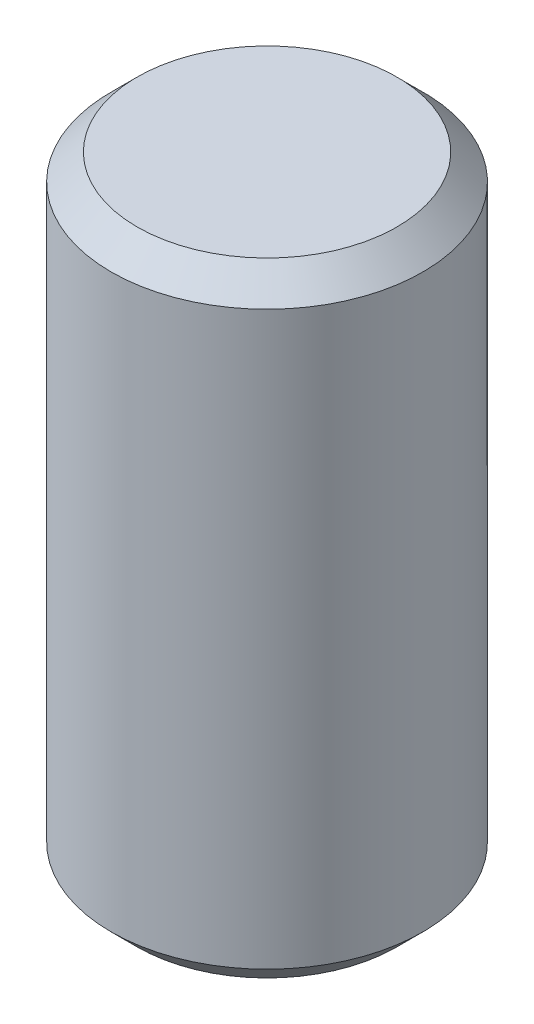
ISO-10303-21;
HEADER;
FILE_DESCRIPTION(('STEP AP214'),'2;1');
FILE_NAME('part.step','',(''),(''),'','','');
FILE_SCHEMA(('AUTOMOTIVE_DESIGN { 1 0 10303 214 1 1 1 1 }'));
ENDSEC;
DATA;
#1=APPLICATION_CONTEXT('core data for automotive mechanical design processes');
#2=APPLICATION_PROTOCOL_DEFINITION('international standard','automotive_design',2000,#1);
#3=PRODUCT_CONTEXT('',#1,'mechanical');
#4=PRODUCT('Part','Part','',(#3));
#5=PRODUCT_RELATED_PRODUCT_CATEGORY('part','',(#4));
#6=PRODUCT_DEFINITION_FORMATION('','',#4);
#7=PRODUCT_DEFINITION_CONTEXT('part definition',#1,'design');
#8=PRODUCT_DEFINITION('design','',#6,#7);
#9=PRODUCT_DEFINITION_SHAPE('','',#8);
#10=(LENGTH_UNIT() NAMED_UNIT(*) SI_UNIT(.MILLI.,.METRE.));
#11=(NAMED_UNIT(*) PLANE_ANGLE_UNIT() SI_UNIT($,.RADIAN.));
#12=(NAMED_UNIT(*) SI_UNIT($,.STERADIAN.) SOLID_ANGLE_UNIT());
#13=UNCERTAINTY_MEASURE_WITH_UNIT(LENGTH_MEASURE(1.E-05),#10,'distance_accuracy_value','');
#14=(GEOMETRIC_REPRESENTATION_CONTEXT(3) GLOBAL_UNCERTAINTY_ASSIGNED_CONTEXT((#13)) GLOBAL_UNIT_ASSIGNED_CONTEXT((#10,
#11,#12)) REPRESENTATION_CONTEXT('',''));
#15=CARTESIAN_POINT('',(0.,0.,0.));
#16=DIRECTION('',(0.,0.,1.));
#17=DIRECTION('',(1.,0.,0.));
#18=AXIS2_PLACEMENT_3D('',#15,#16,#17);
#19=CARTESIAN_POINT('',(0.,6.,0.));
#20=DIRECTION('',(0.,-1.,0.));
#21=DIRECTION('',(0.,0.,-1.));
#22=AXIS2_PLACEMENT_3D('',#19,#20,#21);
#23=CYLINDRICAL_SURFACE('',#22,1.5);
#24=CARTESIAN_POINT('',(0.,0.25,0.));
#25=DIRECTION('',(0.,1.,0.));
#26=DIRECTION('',(0.,0.,1.));
#27=AXIS2_PLACEMENT_3D('',#24,#25,#26);
#28=CIRCLE('',#27,1.5);
#29=CARTESIAN_POINT('',(0.,0.25,1.5));
#30=VERTEX_POINT('',#29);
#31=EDGE_CURVE('E44',#30,#30,#28,.T.);
#32=ORIENTED_EDGE('',*,*,#31,.T.);
#33=EDGE_LOOP('',(#32));
#34=FACE_BOUND('',#33,.T.);
#35=CARTESIAN_POINT('',(0.,5.75,0.));
#36=DIRECTION('',(0.,1.,0.));
#37=DIRECTION('',(0.,0.,1.));
#38=AXIS2_PLACEMENT_3D('',#35,#36,#37);
#39=CIRCLE('',#38,1.5);
#40=CARTESIAN_POINT('',(0.,5.75,1.5));
#41=VERTEX_POINT('',#40);
#42=EDGE_CURVE('E48',#41,#41,#39,.F.);
#43=ORIENTED_EDGE('',*,*,#42,.T.);
#44=EDGE_LOOP('',(#43));
#45=FACE_BOUND('',#44,.T.);
#46=ADVANCED_FACE('F32',(#34,#45),#23,.T.);
#47=CARTESIAN_POINT('',(0.,6.,0.));
#48=DIRECTION('',(0.,1.,0.));
#49=DIRECTION('',(0.,0.,1.));
#50=AXIS2_PLACEMENT_3D('',#47,#48,#49);
#51=PLANE('',#50);
#52=CARTESIAN_POINT('',(0.,6.,0.));
#53=DIRECTION('',(0.,1.,0.));
#54=DIRECTION('',(0.,0.,1.));
#55=AXIS2_PLACEMENT_3D('',#52,#53,#54);
#56=CIRCLE('',#55,1.25);
#57=CARTESIAN_POINT('',(0.,6.,1.25));
#58=VERTEX_POINT('',#57);
#59=EDGE_CURVE('E10',#58,#58,#56,.T.);
#60=ORIENTED_EDGE('',*,*,#59,.T.);
#61=EDGE_LOOP('',(#60));
#62=FACE_BOUND('',#61,.T.);
#63=ADVANCED_FACE('F64',(#62),#51,.T.);
#64=CARTESIAN_POINT('',(0.,0.,0.));
#65=DIRECTION('',(0.,1.,0.));
#66=DIRECTION('',(0.,0.,1.));
#67=AXIS2_PLACEMENT_3D('',#64,#65,#66);
#68=PLANE('',#67);
#69=CARTESIAN_POINT('',(0.,0.,0.));
#70=DIRECTION('',(0.,1.,0.));
#71=DIRECTION('',(0.,0.,1.));
#72=AXIS2_PLACEMENT_3D('',#69,#70,#71);
#73=CIRCLE('',#72,1.25);
#74=CARTESIAN_POINT('',(0.,0.,1.25));
#75=VERTEX_POINT('',#74);
#76=EDGE_CURVE('E40',#75,#75,#73,.F.);
#77=ORIENTED_EDGE('',*,*,#76,.T.);
#78=EDGE_LOOP('',(#77));
#79=FACE_BOUND('',#78,.T.);
#80=ADVANCED_FACE('F61',(#79),#68,.F.);
#81=CARTESIAN_POINT('',(0.,0.25,0.));
#82=DIRECTION('',(0.,1.,0.));
#83=DIRECTION('',(0.,0.,1.));
#84=AXIS2_PLACEMENT_3D('',#81,#82,#83);
#85=CONICAL_SURFACE('',#84,1.5,0.785398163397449);
#86=ORIENTED_EDGE('',*,*,#76,.F.);
#87=EDGE_LOOP('',(#86));
#88=FACE_BOUND('',#87,.T.);
#89=ORIENTED_EDGE('',*,*,#31,.F.);
#90=EDGE_LOOP('',(#89));
#91=FACE_BOUND('',#90,.T.);
#92=ADVANCED_FACE('F57',(#88,#91),#85,.T.);
#93=CARTESIAN_POINT('',(0.,6.,0.));
#94=DIRECTION('',(0.,-1.,0.));
#95=DIRECTION('',(0.,0.,-1.));
#96=AXIS2_PLACEMENT_3D('',#93,#94,#95);
#97=CONICAL_SURFACE('',#96,1.25,0.785398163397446);
#98=ORIENTED_EDGE('',*,*,#42,.F.);
#99=EDGE_LOOP('',(#98));
#100=FACE_BOUND('',#99,.T.);
#101=ORIENTED_EDGE('',*,*,#59,.F.);
#102=EDGE_LOOP('',(#101));
#103=FACE_BOUND('',#102,.T.);
#104=ADVANCED_FACE('F35',(#100,#103),#97,.T.);
#105=CLOSED_SHELL('',(#46,#63,#80,#92,#104));
#106=MANIFOLD_SOLID_BREP('B2',#105);
#107=ADVANCED_BREP_SHAPE_REPRESENTATION('',(#18,#106),#14);
#108=SHAPE_DEFINITION_REPRESENTATION(#9,#107);
ENDSEC;
END-ISO-10303-21;
